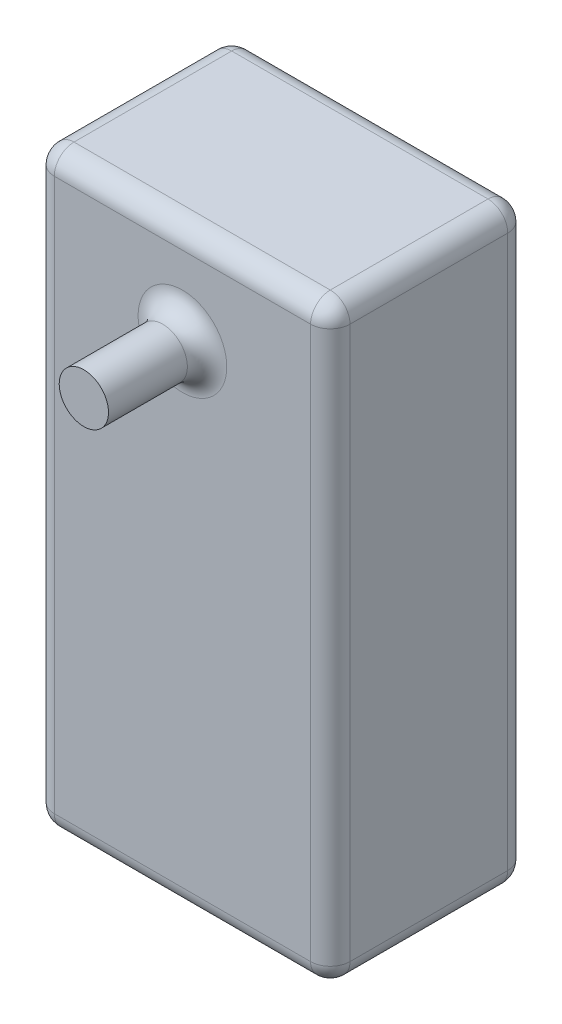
ISO-10303-21;
HEADER;
FILE_DESCRIPTION(('STEP AP214'),'2;1');
FILE_NAME('part.step','',(''),(''),'','','');
FILE_SCHEMA(('AUTOMOTIVE_DESIGN { 1 0 10303 214 1 1 1 1 }'));
ENDSEC;
DATA;
#1=APPLICATION_CONTEXT('core data for automotive mechanical design processes');
#2=APPLICATION_PROTOCOL_DEFINITION('international standard','automotive_design',2000,#1);
#3=PRODUCT_CONTEXT('',#1,'mechanical');
#4=PRODUCT('Part','Part','',(#3));
#5=PRODUCT_RELATED_PRODUCT_CATEGORY('part','',(#4));
#6=PRODUCT_DEFINITION_FORMATION('','',#4);
#7=PRODUCT_DEFINITION_CONTEXT('part definition',#1,'design');
#8=PRODUCT_DEFINITION('design','',#6,#7);
#9=PRODUCT_DEFINITION_SHAPE('','',#8);
#10=(LENGTH_UNIT() NAMED_UNIT(*) SI_UNIT(.MILLI.,.METRE.));
#11=(NAMED_UNIT(*) PLANE_ANGLE_UNIT() SI_UNIT($,.RADIAN.));
#12=(NAMED_UNIT(*) SI_UNIT($,.STERADIAN.) SOLID_ANGLE_UNIT());
#13=UNCERTAINTY_MEASURE_WITH_UNIT(LENGTH_MEASURE(1.E-05),#10,'distance_accuracy_value','');
#14=(GEOMETRIC_REPRESENTATION_CONTEXT(3) GLOBAL_UNCERTAINTY_ASSIGNED_CONTEXT((#13)) GLOBAL_UNIT_ASSIGNED_CONTEXT((#10,
#11,#12)) REPRESENTATION_CONTEXT('',''));
#15=CARTESIAN_POINT('',(0.,0.,0.));
#16=DIRECTION('',(0.,0.,1.));
#17=DIRECTION('',(1.,0.,0.));
#18=AXIS2_PLACEMENT_3D('',#15,#16,#17);
#19=CARTESIAN_POINT('',(0.,0.,20.));
#20=DIRECTION('',(1.,0.,0.));
#21=DIRECTION('',(0.,0.,-1.));
#22=AXIS2_PLACEMENT_3D('',#19,#20,#21);
#23=PLANE('',#22);
#24=DIRECTION('',(0.,0.,-1.));
#25=VECTOR('',#24,1.);
#26=CARTESIAN_POINT('',(0.,2.,20.));
#27=LINE('',#26,#25);
#28=CARTESIAN_POINT('',(0.,2.,2.));
#29=VERTEX_POINT('',#28);
#30=CARTESIAN_POINT('',(0.,2.,18.));
#31=VERTEX_POINT('',#30);
#32=EDGE_CURVE('E204',#29,#31,#27,.F.);
#33=ORIENTED_EDGE('',*,*,#32,.T.);
#34=DIRECTION('',(0.,-1.,0.));
#35=VECTOR('',#34,1.);
#36=CARTESIAN_POINT('',(0.,0.,18.));
#37=LINE('',#36,#35);
#38=CARTESIAN_POINT('',(0.,58.,18.));
#39=VERTEX_POINT('',#38);
#40=EDGE_CURVE('E211',#31,#39,#37,.F.);
#41=ORIENTED_EDGE('',*,*,#40,.T.);
#42=DIRECTION('',(0.,0.,-1.));
#43=VECTOR('',#42,1.);
#44=CARTESIAN_POINT('',(0.,58.,20.));
#45=LINE('',#44,#43);
#46=CARTESIAN_POINT('',(0.,58.,2.));
#47=VERTEX_POINT('',#46);
#48=EDGE_CURVE('E207',#39,#47,#45,.T.);
#49=ORIENTED_EDGE('',*,*,#48,.T.);
#50=DIRECTION('',(0.,-1.,0.));
#51=VECTOR('',#50,1.);
#52=CARTESIAN_POINT('',(0.,0.,2.));
#53=LINE('',#52,#51);
#54=EDGE_CURVE('E201',#47,#29,#53,.T.);
#55=ORIENTED_EDGE('',*,*,#54,.T.);
#56=EDGE_LOOP('',(#33,#41,#49,#55));
#57=FACE_BOUND('',#56,.T.);
#58=ADVANCED_FACE('F43',(#57),#23,.F.);
#59=CARTESIAN_POINT('',(0.,0.,20.));
#60=DIRECTION('',(0.,1.,0.));
#61=DIRECTION('',(-1.,0.,0.));
#62=AXIS2_PLACEMENT_3D('',#59,#60,#61);
#63=PLANE('',#62);
#64=DIRECTION('',(0.,0.,-1.));
#65=VECTOR('',#64,1.);
#66=CARTESIAN_POINT('',(28.,0.,20.));
#67=LINE('',#66,#65);
#68=CARTESIAN_POINT('',(28.,0.,2.));
#69=VERTEX_POINT('',#68);
#70=CARTESIAN_POINT('',(28.,0.,18.));
#71=VERTEX_POINT('',#70);
#72=EDGE_CURVE('E194',#69,#71,#67,.F.);
#73=ORIENTED_EDGE('',*,*,#72,.T.);
#74=DIRECTION('',(1.,0.,0.));
#75=VECTOR('',#74,1.);
#76=CARTESIAN_POINT('',(0.,0.,18.));
#77=LINE('',#76,#75);
#78=CARTESIAN_POINT('',(2.,0.,18.));
#79=VERTEX_POINT('',#78);
#80=EDGE_CURVE('E198',#71,#79,#77,.F.);
#81=ORIENTED_EDGE('',*,*,#80,.T.);
#82=DIRECTION('',(0.,0.,-1.));
#83=VECTOR('',#82,1.);
#84=CARTESIAN_POINT('',(2.,0.,20.));
#85=LINE('',#84,#83);
#86=CARTESIAN_POINT('',(2.,0.,2.));
#87=VERTEX_POINT('',#86);
#88=EDGE_CURVE('E191',#79,#87,#85,.T.);
#89=ORIENTED_EDGE('',*,*,#88,.T.);
#90=DIRECTION('',(1.,0.,0.));
#91=VECTOR('',#90,1.);
#92=CARTESIAN_POINT('',(30.,0.,2.));
#93=LINE('',#92,#91);
#94=EDGE_CURVE('E188',#87,#69,#93,.T.);
#95=ORIENTED_EDGE('',*,*,#94,.T.);
#96=EDGE_LOOP('',(#73,#81,#89,#95));
#97=FACE_BOUND('',#96,.T.);
#98=ADVANCED_FACE('F346',(#97),#63,.F.);
#99=CARTESIAN_POINT('',(30.,0.,20.));
#100=DIRECTION('',(-1.,0.,0.));
#101=DIRECTION('',(0.,-1.,0.));
#102=AXIS2_PLACEMENT_3D('',#99,#100,#101);
#103=PLANE('',#102);
#104=DIRECTION('',(0.,0.,-1.));
#105=VECTOR('',#104,1.);
#106=CARTESIAN_POINT('',(30.,58.,20.));
#107=LINE('',#106,#105);
#108=CARTESIAN_POINT('',(30.,58.,2.));
#109=VERTEX_POINT('',#108);
#110=CARTESIAN_POINT('',(30.,58.,18.));
#111=VERTEX_POINT('',#110);
#112=EDGE_CURVE('E139',#109,#111,#107,.F.);
#113=ORIENTED_EDGE('',*,*,#112,.T.);
#114=DIRECTION('',(0.,1.,0.));
#115=VECTOR('',#114,1.);
#116=CARTESIAN_POINT('',(30.,0.,18.));
#117=LINE('',#116,#115);
#118=CARTESIAN_POINT('',(30.,2.,18.));
#119=VERTEX_POINT('',#118);
#120=EDGE_CURVE('E185',#111,#119,#117,.F.);
#121=ORIENTED_EDGE('',*,*,#120,.T.);
#122=DIRECTION('',(0.,0.,-1.));
#123=VECTOR('',#122,1.);
#124=CARTESIAN_POINT('',(30.,2.,20.));
#125=LINE('',#124,#123);
#126=CARTESIAN_POINT('',(30.,2.,2.));
#127=VERTEX_POINT('',#126);
#128=EDGE_CURVE('E180',#119,#127,#125,.T.);
#129=ORIENTED_EDGE('',*,*,#128,.T.);
#130=DIRECTION('',(0.,1.,0.));
#131=VECTOR('',#130,1.);
#132=CARTESIAN_POINT('',(30.,60.,2.));
#133=LINE('',#132,#131);
#134=EDGE_CURVE('E174',#127,#109,#133,.T.);
#135=ORIENTED_EDGE('',*,*,#134,.T.);
#136=EDGE_LOOP('',(#113,#121,#129,#135));
#137=FACE_BOUND('',#136,.T.);
#138=ADVANCED_FACE('F352',(#137),#103,.F.);
#139=CARTESIAN_POINT('',(0.,60.,20.));
#140=DIRECTION('',(0.,-1.,0.));
#141=DIRECTION('',(0.,0.,-1.));
#142=AXIS2_PLACEMENT_3D('',#139,#140,#141);
#143=PLANE('',#142);
#144=DIRECTION('',(0.,0.,-1.));
#145=VECTOR('',#144,1.);
#146=CARTESIAN_POINT('',(2.,60.,20.));
#147=LINE('',#146,#145);
#148=CARTESIAN_POINT('',(2.,60.,2.));
#149=VERTEX_POINT('',#148);
#150=CARTESIAN_POINT('',(2.,60.,18.));
#151=VERTEX_POINT('',#150);
#152=EDGE_CURVE('E163',#149,#151,#147,.F.);
#153=ORIENTED_EDGE('',*,*,#152,.T.);
#154=DIRECTION('',(-1.,0.,0.));
#155=VECTOR('',#154,1.);
#156=CARTESIAN_POINT('',(0.,60.,18.));
#157=LINE('',#156,#155);
#158=CARTESIAN_POINT('',(28.,60.,18.));
#159=VERTEX_POINT('',#158);
#160=EDGE_CURVE('E168',#151,#159,#157,.F.);
#161=ORIENTED_EDGE('',*,*,#160,.T.);
#162=DIRECTION('',(0.,0.,-1.));
#163=VECTOR('',#162,1.);
#164=CARTESIAN_POINT('',(28.,60.,20.));
#165=LINE('',#164,#163);
#166=CARTESIAN_POINT('',(28.,60.,2.));
#167=VERTEX_POINT('',#166);
#168=EDGE_CURVE('E137',#159,#167,#165,.T.);
#169=ORIENTED_EDGE('',*,*,#168,.T.);
#170=DIRECTION('',(-1.,0.,0.));
#171=VECTOR('',#170,1.);
#172=CARTESIAN_POINT('',(0.,60.,2.));
#173=LINE('',#172,#171);
#174=EDGE_CURVE('E156',#167,#149,#173,.T.);
#175=ORIENTED_EDGE('',*,*,#174,.T.);
#176=EDGE_LOOP('',(#153,#161,#169,#175));
#177=FACE_BOUND('',#176,.T.);
#178=ADVANCED_FACE('F166',(#177),#143,.F.);
#179=CARTESIAN_POINT('',(0.,0.,20.));
#180=DIRECTION('',(0.,0.,-1.));
#181=DIRECTION('',(-1.,0.,0.));
#182=AXIS2_PLACEMENT_3D('',#179,#180,#181);
#183=PLANE('',#182);
#184=DIRECTION('',(0.,1.,0.));
#185=VECTOR('',#184,1.);
#186=CARTESIAN_POINT('',(28.,0.,20.));
#187=LINE('',#186,#185);
#188=CARTESIAN_POINT('',(28.,2.,20.));
#189=VERTEX_POINT('',#188);
#190=CARTESIAN_POINT('',(28.,58.,20.));
#191=VERTEX_POINT('',#190);
#192=EDGE_CURVE('E224',#189,#191,#187,.T.);
#193=ORIENTED_EDGE('',*,*,#192,.T.);
#194=DIRECTION('',(-1.,0.,0.));
#195=VECTOR('',#194,1.);
#196=CARTESIAN_POINT('',(0.,58.,20.));
#197=LINE('',#196,#195);
#198=CARTESIAN_POINT('',(2.,58.,20.));
#199=VERTEX_POINT('',#198);
#200=EDGE_CURVE('E227',#191,#199,#197,.T.);
#201=ORIENTED_EDGE('',*,*,#200,.T.);
#202=DIRECTION('',(0.,-1.,0.));
#203=VECTOR('',#202,1.);
#204=CARTESIAN_POINT('',(2.,0.,20.));
#205=LINE('',#204,#203);
#206=CARTESIAN_POINT('',(2.,2.,20.));
#207=VERTEX_POINT('',#206);
#208=EDGE_CURVE('E218',#199,#207,#205,.T.);
#209=ORIENTED_EDGE('',*,*,#208,.T.);
#210=DIRECTION('',(1.,0.,0.));
#211=VECTOR('',#210,1.);
#212=CARTESIAN_POINT('',(0.,2.,20.));
#213=LINE('',#212,#211);
#214=EDGE_CURVE('E221',#207,#189,#213,.T.);
#215=ORIENTED_EDGE('',*,*,#214,.T.);
#216=EDGE_LOOP('',(#193,#201,#209,#215));
#217=FACE_BOUND('',#216,.T.);
#218=CARTESIAN_POINT('',(15.,50.,20.));
#219=DIRECTION('',(0.,0.,-1.));
#220=DIRECTION('',(-1.,0.,0.));
#221=AXIS2_PLACEMENT_3D('',#218,#219,#220);
#222=CIRCLE('',#221,4.5);
#223=CARTESIAN_POINT('',(10.5,50.,20.));
#224=VERTEX_POINT('',#223);
#225=EDGE_CURVE('E214',#224,#224,#222,.T.);
#226=ORIENTED_EDGE('',*,*,#225,.T.);
#227=EDGE_LOOP('',(#226));
#228=FACE_BOUND('',#227,.T.);
#229=ADVANCED_FACE('F342',(#217,#228),#183,.F.);
#230=CARTESIAN_POINT('',(0.,0.,0.));
#231=DIRECTION('',(0.,0.,-1.));
#232=DIRECTION('',(-1.,0.,0.));
#233=AXIS2_PLACEMENT_3D('',#230,#231,#232);
#234=PLANE('',#233);
#235=DIRECTION('',(0.,1.,0.));
#236=VECTOR('',#235,1.);
#237=CARTESIAN_POINT('',(28.,0.,0.));
#238=LINE('',#237,#236);
#239=CARTESIAN_POINT('',(28.,58.,0.));
#240=VERTEX_POINT('',#239);
#241=CARTESIAN_POINT('',(28.,2.,0.));
#242=VERTEX_POINT('',#241);
#243=EDGE_CURVE('E53',#240,#242,#238,.F.);
#244=ORIENTED_EDGE('',*,*,#243,.T.);
#245=DIRECTION('',(1.,0.,0.));
#246=VECTOR('',#245,1.);
#247=CARTESIAN_POINT('',(0.,2.,0.));
#248=LINE('',#247,#246);
#249=CARTESIAN_POINT('',(2.,2.,0.));
#250=VERTEX_POINT('',#249);
#251=EDGE_CURVE('E11',#242,#250,#248,.F.);
#252=ORIENTED_EDGE('',*,*,#251,.T.);
#253=DIRECTION('',(0.,-1.,0.));
#254=VECTOR('',#253,1.);
#255=CARTESIAN_POINT('',(2.,60.,0.));
#256=LINE('',#255,#254);
#257=CARTESIAN_POINT('',(2.,58.,0.));
#258=VERTEX_POINT('',#257);
#259=EDGE_CURVE('E235',#250,#258,#256,.F.);
#260=ORIENTED_EDGE('',*,*,#259,.T.);
#261=DIRECTION('',(-1.,0.,0.));
#262=VECTOR('',#261,1.);
#263=CARTESIAN_POINT('',(30.,58.,0.));
#264=LINE('',#263,#262);
#265=EDGE_CURVE('E64',#258,#240,#264,.F.);
#266=ORIENTED_EDGE('',*,*,#265,.T.);
#267=EDGE_LOOP('',(#244,#252,#260,#266));
#268=FACE_BOUND('',#267,.T.);
#269=ADVANCED_FACE('F333',(#268),#234,.T.);
#270=CARTESIAN_POINT('',(15.,50.,30.));
#271=DIRECTION('',(0.,0.,-1.));
#272=DIRECTION('',(-1.,0.,0.));
#273=AXIS2_PLACEMENT_3D('',#270,#271,#272);
#274=CYLINDRICAL_SURFACE('',#273,2.5);
#275=CARTESIAN_POINT('',(15.,50.,22.));
#276=DIRECTION('',(0.,0.,-1.));
#277=DIRECTION('',(-1.,0.,0.));
#278=AXIS2_PLACEMENT_3D('',#275,#276,#277);
#279=CIRCLE('',#278,2.5);
#280=CARTESIAN_POINT('',(12.5,50.,22.));
#281=VERTEX_POINT('',#280);
#282=EDGE_CURVE('E231',#281,#281,#279,.F.);
#283=ORIENTED_EDGE('',*,*,#282,.T.);
#284=EDGE_LOOP('',(#283));
#285=FACE_BOUND('',#284,.T.);
#286=CARTESIAN_POINT('',(15.,50.,30.));
#287=DIRECTION('',(0.,0.,1.));
#288=DIRECTION('',(1.,0.,0.));
#289=AXIS2_PLACEMENT_3D('',#286,#287,#288);
#290=CIRCLE('',#289,2.5);
#291=CARTESIAN_POINT('',(17.5,50.,30.));
#292=VERTEX_POINT('',#291);
#293=EDGE_CURVE('E164',#292,#292,#290,.T.);
#294=ORIENTED_EDGE('',*,*,#293,.F.);
#295=EDGE_LOOP('',(#294));
#296=FACE_BOUND('',#295,.T.);
#297=ADVANCED_FACE('F331',(#285,#296),#274,.T.);
#298=CARTESIAN_POINT('',(15.,50.,30.));
#299=DIRECTION('',(0.,0.,1.));
#300=DIRECTION('',(1.,0.,0.));
#301=AXIS2_PLACEMENT_3D('',#298,#299,#300);
#302=PLANE('',#301);
#303=ORIENTED_EDGE('',*,*,#293,.T.);
#304=EDGE_LOOP('',(#303));
#305=FACE_BOUND('',#304,.T.);
#306=ADVANCED_FACE('F329',(#305),#302,.T.);
#307=CARTESIAN_POINT('',(2.,2.,20.));
#308=DIRECTION('',(0.,0.,-1.));
#309=DIRECTION('',(-1.,0.,0.));
#310=AXIS2_PLACEMENT_3D('',#307,#308,#309);
#311=CYLINDRICAL_SURFACE('',#310,2.);
#312=CARTESIAN_POINT('',(2.,2.,18.));
#313=DIRECTION('',(0.,0.,1.));
#314=DIRECTION('',(1.,0.,0.));
#315=AXIS2_PLACEMENT_3D('',#312,#313,#314);
#316=CIRCLE('',#315,2.);
#317=EDGE_CURVE('E47',#31,#79,#316,.T.);
#318=ORIENTED_EDGE('',*,*,#317,.F.);
#319=ORIENTED_EDGE('',*,*,#32,.F.);
#320=CARTESIAN_POINT('',(2.,2.,2.));
#321=DIRECTION('',(0.,0.,-1.));
#322=DIRECTION('',(-1.,0.,0.));
#323=AXIS2_PLACEMENT_3D('',#320,#321,#322);
#324=CIRCLE('',#323,2.);
#325=EDGE_CURVE('E311',#87,#29,#324,.T.);
#326=ORIENTED_EDGE('',*,*,#325,.F.);
#327=ORIENTED_EDGE('',*,*,#88,.F.);
#328=EDGE_LOOP('',(#318,#319,#326,#327));
#329=FACE_BOUND('',#328,.T.);
#330=ADVANCED_FACE('F340',(#329),#311,.T.);
#331=CARTESIAN_POINT('',(2.,2.,18.));
#332=DIRECTION('',(0.,-1.,0.));
#333=DIRECTION('',(0.,0.,-1.));
#334=AXIS2_PLACEMENT_3D('',#331,#332,#333);
#335=SPHERICAL_SURFACE('',#334,2.);
#336=CARTESIAN_POINT('',(2.,2.,18.));
#337=DIRECTION('',(0.,-1.,0.));
#338=DIRECTION('',(0.,0.,-1.));
#339=AXIS2_PLACEMENT_3D('',#336,#337,#338);
#340=CIRCLE('',#339,2.);
#341=EDGE_CURVE('E304',#31,#207,#340,.F.);
#342=ORIENTED_EDGE('',*,*,#341,.F.);
#343=ORIENTED_EDGE('',*,*,#317,.T.);
#344=CARTESIAN_POINT('',(2.,2.,18.));
#345=DIRECTION('',(-1.,0.,0.));
#346=DIRECTION('',(0.,0.,1.));
#347=AXIS2_PLACEMENT_3D('',#344,#345,#346);
#348=CIRCLE('',#347,2.);
#349=EDGE_CURVE('E308',#207,#79,#348,.F.);
#350=ORIENTED_EDGE('',*,*,#349,.F.);
#351=EDGE_LOOP('',(#342,#343,#350));
#352=FACE_BOUND('',#351,.T.);
#353=ADVANCED_FACE('F422',(#352),#335,.T.);
#354=CARTESIAN_POINT('',(2.,2.,2.));
#355=DIRECTION('',(-1.,0.,0.));
#356=DIRECTION('',(0.,0.,1.));
#357=AXIS2_PLACEMENT_3D('',#354,#355,#356);
#358=SPHERICAL_SURFACE('',#357,2.);
#359=CARTESIAN_POINT('',(2.,2.,2.));
#360=DIRECTION('',(-1.,0.,0.));
#361=DIRECTION('',(0.,0.,1.));
#362=AXIS2_PLACEMENT_3D('',#359,#360,#361);
#363=CIRCLE('',#362,2.);
#364=EDGE_CURVE('E296',#87,#250,#363,.F.);
#365=ORIENTED_EDGE('',*,*,#364,.F.);
#366=ORIENTED_EDGE('',*,*,#325,.T.);
#367=CARTESIAN_POINT('',(2.,2.,2.));
#368=DIRECTION('',(0.,-1.,0.));
#369=DIRECTION('',(0.,0.,-1.));
#370=AXIS2_PLACEMENT_3D('',#367,#368,#369);
#371=CIRCLE('',#370,2.);
#372=EDGE_CURVE('E300',#250,#29,#371,.F.);
#373=ORIENTED_EDGE('',*,*,#372,.F.);
#374=EDGE_LOOP('',(#365,#366,#373));
#375=FACE_BOUND('',#374,.T.);
#376=ADVANCED_FACE('F418',(#375),#358,.T.);
#377=CARTESIAN_POINT('',(0.,2.,18.));
#378=DIRECTION('',(1.,0.,0.));
#379=DIRECTION('',(0.,1.,0.));
#380=AXIS2_PLACEMENT_3D('',#377,#378,#379);
#381=CYLINDRICAL_SURFACE('',#380,2.);
#382=ORIENTED_EDGE('',*,*,#349,.T.);
#383=ORIENTED_EDGE('',*,*,#80,.F.);
#384=CARTESIAN_POINT('',(28.,2.,18.));
#385=DIRECTION('',(1.,0.,0.));
#386=DIRECTION('',(0.,0.,-1.));
#387=AXIS2_PLACEMENT_3D('',#384,#385,#386);
#388=CIRCLE('',#387,2.);
#389=EDGE_CURVE('E289',#189,#71,#388,.T.);
#390=ORIENTED_EDGE('',*,*,#389,.F.);
#391=ORIENTED_EDGE('',*,*,#214,.F.);
#392=EDGE_LOOP('',(#382,#383,#390,#391));
#393=FACE_BOUND('',#392,.T.);
#394=ADVANCED_FACE('F414',(#393),#381,.T.);
#395=CARTESIAN_POINT('',(2.,0.,18.));
#396=DIRECTION('',(0.,-1.,0.));
#397=DIRECTION('',(0.,0.,-1.));
#398=AXIS2_PLACEMENT_3D('',#395,#396,#397);
#399=CYLINDRICAL_SURFACE('',#398,2.);
#400=ORIENTED_EDGE('',*,*,#341,.T.);
#401=ORIENTED_EDGE('',*,*,#208,.F.);
#402=CARTESIAN_POINT('',(2.,58.,18.));
#403=DIRECTION('',(0.,1.,0.));
#404=DIRECTION('',(0.,0.,1.));
#405=AXIS2_PLACEMENT_3D('',#402,#403,#404);
#406=CIRCLE('',#405,2.);
#407=EDGE_CURVE('E285',#39,#199,#406,.T.);
#408=ORIENTED_EDGE('',*,*,#407,.F.);
#409=ORIENTED_EDGE('',*,*,#40,.F.);
#410=EDGE_LOOP('',(#400,#401,#408,#409));
#411=FACE_BOUND('',#410,.T.);
#412=ADVANCED_FACE('F410',(#411),#399,.T.);
#413=CARTESIAN_POINT('',(2.,58.,20.));
#414=DIRECTION('',(0.,0.,-1.));
#415=DIRECTION('',(-1.,0.,0.));
#416=AXIS2_PLACEMENT_3D('',#413,#414,#415);
#417=CYLINDRICAL_SURFACE('',#416,2.);
#418=CARTESIAN_POINT('',(2.,58.,2.));
#419=DIRECTION('',(0.,0.,-1.));
#420=DIRECTION('',(-1.,0.,0.));
#421=AXIS2_PLACEMENT_3D('',#418,#419,#420);
#422=CIRCLE('',#421,2.);
#423=EDGE_CURVE('E277',#47,#149,#422,.T.);
#424=ORIENTED_EDGE('',*,*,#423,.F.);
#425=ORIENTED_EDGE('',*,*,#48,.F.);
#426=CARTESIAN_POINT('',(2.,58.,18.));
#427=DIRECTION('',(0.,0.,1.));
#428=DIRECTION('',(1.,0.,0.));
#429=AXIS2_PLACEMENT_3D('',#426,#427,#428);
#430=CIRCLE('',#429,2.);
#431=EDGE_CURVE('E281',#151,#39,#430,.T.);
#432=ORIENTED_EDGE('',*,*,#431,.F.);
#433=ORIENTED_EDGE('',*,*,#152,.F.);
#434=EDGE_LOOP('',(#424,#425,#432,#433));
#435=FACE_BOUND('',#434,.T.);
#436=ADVANCED_FACE('F406',(#435),#417,.T.);
#437=CARTESIAN_POINT('',(2.,0.,2.));
#438=DIRECTION('',(0.,1.,0.));
#439=DIRECTION('',(0.,0.,1.));
#440=AXIS2_PLACEMENT_3D('',#437,#438,#439);
#441=CYLINDRICAL_SURFACE('',#440,2.);
#442=ORIENTED_EDGE('',*,*,#372,.T.);
#443=ORIENTED_EDGE('',*,*,#54,.F.);
#444=CARTESIAN_POINT('',(2.,58.,2.));
#445=DIRECTION('',(0.,1.,0.));
#446=DIRECTION('',(0.,0.,1.));
#447=AXIS2_PLACEMENT_3D('',#444,#445,#446);
#448=CIRCLE('',#447,2.);
#449=EDGE_CURVE('E274',#258,#47,#448,.T.);
#450=ORIENTED_EDGE('',*,*,#449,.F.);
#451=ORIENTED_EDGE('',*,*,#259,.F.);
#452=EDGE_LOOP('',(#442,#443,#450,#451));
#453=FACE_BOUND('',#452,.T.);
#454=ADVANCED_FACE('F402',(#453),#441,.T.);
#455=CARTESIAN_POINT('',(0.,2.,2.));
#456=DIRECTION('',(-1.,0.,0.));
#457=DIRECTION('',(0.,-1.,0.));
#458=AXIS2_PLACEMENT_3D('',#455,#456,#457);
#459=CYLINDRICAL_SURFACE('',#458,2.);
#460=ORIENTED_EDGE('',*,*,#364,.T.);
#461=ORIENTED_EDGE('',*,*,#251,.F.);
#462=CARTESIAN_POINT('',(28.,2.,2.));
#463=DIRECTION('',(1.,0.,0.));
#464=DIRECTION('',(0.,0.,-1.));
#465=AXIS2_PLACEMENT_3D('',#462,#463,#464);
#466=CIRCLE('',#465,2.);
#467=EDGE_CURVE('E270',#69,#242,#466,.T.);
#468=ORIENTED_EDGE('',*,*,#467,.F.);
#469=ORIENTED_EDGE('',*,*,#94,.F.);
#470=EDGE_LOOP('',(#460,#461,#468,#469));
#471=FACE_BOUND('',#470,.T.);
#472=ADVANCED_FACE('F398',(#471),#459,.T.);
#473=CARTESIAN_POINT('',(28.,2.,20.));
#474=DIRECTION('',(0.,0.,-1.));
#475=DIRECTION('',(-1.,0.,0.));
#476=AXIS2_PLACEMENT_3D('',#473,#474,#475);
#477=CYLINDRICAL_SURFACE('',#476,2.);
#478=CARTESIAN_POINT('',(28.,2.,18.));
#479=DIRECTION('',(0.,0.,1.));
#480=DIRECTION('',(1.,0.,0.));
#481=AXIS2_PLACEMENT_3D('',#478,#479,#480);
#482=CIRCLE('',#481,2.);
#483=EDGE_CURVE('E292',#71,#119,#482,.T.);
#484=ORIENTED_EDGE('',*,*,#483,.F.);
#485=ORIENTED_EDGE('',*,*,#72,.F.);
#486=CARTESIAN_POINT('',(28.,2.,2.));
#487=DIRECTION('',(0.,0.,-1.));
#488=DIRECTION('',(-1.,0.,0.));
#489=AXIS2_PLACEMENT_3D('',#486,#487,#488);
#490=CIRCLE('',#489,2.);
#491=EDGE_CURVE('E266',#127,#69,#490,.T.);
#492=ORIENTED_EDGE('',*,*,#491,.F.);
#493=ORIENTED_EDGE('',*,*,#128,.F.);
#494=EDGE_LOOP('',(#484,#485,#492,#493));
#495=FACE_BOUND('',#494,.T.);
#496=ADVANCED_FACE('F394',(#495),#477,.T.);
#497=CARTESIAN_POINT('',(28.,2.,18.));
#498=DIRECTION('',(0.,-1.,0.));
#499=DIRECTION('',(0.,0.,-1.));
#500=AXIS2_PLACEMENT_3D('',#497,#498,#499);
#501=SPHERICAL_SURFACE('',#500,2.);
#502=ORIENTED_EDGE('',*,*,#389,.T.);
#503=ORIENTED_EDGE('',*,*,#483,.T.);
#504=CARTESIAN_POINT('',(28.,2.,18.));
#505=DIRECTION('',(0.,-1.,0.));
#506=DIRECTION('',(1.,0.,0.));
#507=AXIS2_PLACEMENT_3D('',#504,#505,#506);
#508=CIRCLE('',#507,2.);
#509=EDGE_CURVE('E262',#189,#119,#508,.F.);
#510=ORIENTED_EDGE('',*,*,#509,.F.);
#511=EDGE_LOOP('',(#502,#503,#510));
#512=FACE_BOUND('',#511,.T.);
#513=ADVANCED_FACE('F390',(#512),#501,.T.);
#514=CARTESIAN_POINT('',(2.,58.,18.));
#515=DIRECTION('',(-1.,0.,0.));
#516=DIRECTION('',(0.,0.,1.));
#517=AXIS2_PLACEMENT_3D('',#514,#515,#516);
#518=SPHERICAL_SURFACE('',#517,2.);
#519=ORIENTED_EDGE('',*,*,#431,.T.);
#520=ORIENTED_EDGE('',*,*,#407,.T.);
#521=CARTESIAN_POINT('',(2.,58.,18.));
#522=DIRECTION('',(-1.,0.,0.));
#523=DIRECTION('',(0.,0.,1.));
#524=AXIS2_PLACEMENT_3D('',#521,#522,#523);
#525=CIRCLE('',#524,2.);
#526=EDGE_CURVE('E259',#151,#199,#525,.F.);
#527=ORIENTED_EDGE('',*,*,#526,.F.);
#528=EDGE_LOOP('',(#519,#520,#527));
#529=FACE_BOUND('',#528,.T.);
#530=ADVANCED_FACE('F386',(#529),#518,.T.);
#531=CARTESIAN_POINT('',(2.,58.,2.));
#532=DIRECTION('',(-1.,0.,0.));
#533=DIRECTION('',(0.,0.,1.));
#534=AXIS2_PLACEMENT_3D('',#531,#532,#533);
#535=SPHERICAL_SURFACE('',#534,2.);
#536=ORIENTED_EDGE('',*,*,#449,.T.);
#537=ORIENTED_EDGE('',*,*,#423,.T.);
#538=CARTESIAN_POINT('',(2.,58.,2.));
#539=DIRECTION('',(-1.,0.,0.));
#540=DIRECTION('',(0.,0.,1.));
#541=AXIS2_PLACEMENT_3D('',#538,#539,#540);
#542=CIRCLE('',#541,2.);
#543=EDGE_CURVE('E159',#258,#149,#542,.F.);
#544=ORIENTED_EDGE('',*,*,#543,.F.);
#545=EDGE_LOOP('',(#536,#537,#544));
#546=FACE_BOUND('',#545,.T.);
#547=ADVANCED_FACE('F382',(#546),#535,.T.);
#548=CARTESIAN_POINT('',(28.,2.,2.));
#549=DIRECTION('',(0.,-1.,0.));
#550=DIRECTION('',(0.,0.,-1.));
#551=AXIS2_PLACEMENT_3D('',#548,#549,#550);
#552=SPHERICAL_SURFACE('',#551,2.);
#553=ORIENTED_EDGE('',*,*,#491,.T.);
#554=ORIENTED_EDGE('',*,*,#467,.T.);
#555=CARTESIAN_POINT('',(28.,2.,2.));
#556=DIRECTION('',(0.,-1.,0.));
#557=DIRECTION('',(1.,0.,0.));
#558=AXIS2_PLACEMENT_3D('',#555,#556,#557);
#559=CIRCLE('',#558,2.);
#560=EDGE_CURVE('E253',#127,#242,#559,.F.);
#561=ORIENTED_EDGE('',*,*,#560,.F.);
#562=EDGE_LOOP('',(#553,#554,#561));
#563=FACE_BOUND('',#562,.T.);
#564=ADVANCED_FACE('F378',(#563),#552,.T.);
#565=CARTESIAN_POINT('',(28.,0.,18.));
#566=DIRECTION('',(0.,1.,0.));
#567=DIRECTION('',(-1.,0.,0.));
#568=AXIS2_PLACEMENT_3D('',#565,#566,#567);
#569=CYLINDRICAL_SURFACE('',#568,2.);
#570=ORIENTED_EDGE('',*,*,#509,.T.);
#571=ORIENTED_EDGE('',*,*,#120,.F.);
#572=CARTESIAN_POINT('',(28.,58.,18.));
#573=DIRECTION('',(0.,1.,0.));
#574=DIRECTION('',(0.,0.,1.));
#575=AXIS2_PLACEMENT_3D('',#572,#573,#574);
#576=CIRCLE('',#575,2.);
#577=EDGE_CURVE('E249',#191,#111,#576,.T.);
#578=ORIENTED_EDGE('',*,*,#577,.F.);
#579=ORIENTED_EDGE('',*,*,#192,.F.);
#580=EDGE_LOOP('',(#570,#571,#578,#579));
#581=FACE_BOUND('',#580,.T.);
#582=ADVANCED_FACE('F374',(#581),#569,.T.);
#583=CARTESIAN_POINT('',(0.,58.,18.));
#584=DIRECTION('',(-1.,0.,0.));
#585=DIRECTION('',(0.,0.,1.));
#586=AXIS2_PLACEMENT_3D('',#583,#584,#585);
#587=CYLINDRICAL_SURFACE('',#586,2.);
#588=ORIENTED_EDGE('',*,*,#526,.T.);
#589=ORIENTED_EDGE('',*,*,#200,.F.);
#590=CARTESIAN_POINT('',(28.,58.,18.));
#591=DIRECTION('',(1.,0.,0.));
#592=DIRECTION('',(0.,0.,-1.));
#593=AXIS2_PLACEMENT_3D('',#590,#591,#592);
#594=CIRCLE('',#593,2.);
#595=EDGE_CURVE('E153',#159,#191,#594,.T.);
#596=ORIENTED_EDGE('',*,*,#595,.F.);
#597=ORIENTED_EDGE('',*,*,#160,.F.);
#598=EDGE_LOOP('',(#588,#589,#596,#597));
#599=FACE_BOUND('',#598,.T.);
#600=ADVANCED_FACE('F371',(#599),#587,.T.);
#601=CARTESIAN_POINT('',(0.,58.,2.));
#602=DIRECTION('',(1.,0.,0.));
#603=DIRECTION('',(0.,0.,-1.));
#604=AXIS2_PLACEMENT_3D('',#601,#602,#603);
#605=CYLINDRICAL_SURFACE('',#604,2.);
#606=ORIENTED_EDGE('',*,*,#543,.T.);
#607=ORIENTED_EDGE('',*,*,#174,.F.);
#608=CARTESIAN_POINT('',(28.,58.,2.));
#609=DIRECTION('',(1.,0.,0.));
#610=DIRECTION('',(0.,0.,-1.));
#611=AXIS2_PLACEMENT_3D('',#608,#609,#610);
#612=CIRCLE('',#611,2.);
#613=EDGE_CURVE('E146',#240,#167,#612,.T.);
#614=ORIENTED_EDGE('',*,*,#613,.F.);
#615=ORIENTED_EDGE('',*,*,#265,.F.);
#616=EDGE_LOOP('',(#606,#607,#614,#615));
#617=FACE_BOUND('',#616,.T.);
#618=ADVANCED_FACE('F157',(#617),#605,.T.);
#619=CARTESIAN_POINT('',(28.,0.,2.));
#620=DIRECTION('',(0.,-1.,0.));
#621=DIRECTION('',(1.,0.,0.));
#622=AXIS2_PLACEMENT_3D('',#619,#620,#621);
#623=CYLINDRICAL_SURFACE('',#622,2.);
#624=ORIENTED_EDGE('',*,*,#560,.T.);
#625=ORIENTED_EDGE('',*,*,#243,.F.);
#626=CARTESIAN_POINT('',(28.,58.,2.));
#627=DIRECTION('',(0.,1.,0.));
#628=DIRECTION('',(0.,0.,1.));
#629=AXIS2_PLACEMENT_3D('',#626,#627,#628);
#630=CIRCLE('',#629,2.);
#631=EDGE_CURVE('E150',#109,#240,#630,.T.);
#632=ORIENTED_EDGE('',*,*,#631,.F.);
#633=ORIENTED_EDGE('',*,*,#134,.F.);
#634=EDGE_LOOP('',(#624,#625,#632,#633));
#635=FACE_BOUND('',#634,.T.);
#636=ADVANCED_FACE('F364',(#635),#623,.T.);
#637=CARTESIAN_POINT('',(28.,58.,18.));
#638=DIRECTION('',(0.,0.,1.));
#639=DIRECTION('',(1.,0.,0.));
#640=AXIS2_PLACEMENT_3D('',#637,#638,#639);
#641=SPHERICAL_SURFACE('',#640,2.);
#642=ORIENTED_EDGE('',*,*,#595,.T.);
#643=ORIENTED_EDGE('',*,*,#577,.T.);
#644=CARTESIAN_POINT('',(28.,58.,18.));
#645=DIRECTION('',(0.,0.,1.));
#646=DIRECTION('',(1.,0.,0.));
#647=AXIS2_PLACEMENT_3D('',#644,#645,#646);
#648=CIRCLE('',#647,2.);
#649=EDGE_CURVE('E143',#159,#111,#648,.F.);
#650=ORIENTED_EDGE('',*,*,#649,.F.);
#651=EDGE_LOOP('',(#642,#643,#650));
#652=FACE_BOUND('',#651,.T.);
#653=ADVANCED_FACE('F361',(#652),#641,.T.);
#654=CARTESIAN_POINT('',(28.,58.,2.));
#655=DIRECTION('',(0.,0.,-1.));
#656=DIRECTION('',(-1.,0.,0.));
#657=AXIS2_PLACEMENT_3D('',#654,#655,#656);
#658=SPHERICAL_SURFACE('',#657,2.);
#659=ORIENTED_EDGE('',*,*,#631,.T.);
#660=ORIENTED_EDGE('',*,*,#613,.T.);
#661=CARTESIAN_POINT('',(28.,58.,2.));
#662=DIRECTION('',(0.,0.,-1.));
#663=DIRECTION('',(-1.,0.,0.));
#664=AXIS2_PLACEMENT_3D('',#661,#662,#663);
#665=CIRCLE('',#664,2.);
#666=EDGE_CURVE('E133',#109,#167,#665,.F.);
#667=ORIENTED_EDGE('',*,*,#666,.F.);
#668=EDGE_LOOP('',(#659,#660,#667));
#669=FACE_BOUND('',#668,.T.);
#670=ADVANCED_FACE('F148',(#669),#658,.T.);
#671=CARTESIAN_POINT('',(28.,58.,20.));
#672=DIRECTION('',(0.,0.,-1.));
#673=DIRECTION('',(-1.,0.,0.));
#674=AXIS2_PLACEMENT_3D('',#671,#672,#673);
#675=CYLINDRICAL_SURFACE('',#674,2.);
#676=ORIENTED_EDGE('',*,*,#649,.T.);
#677=ORIENTED_EDGE('',*,*,#112,.F.);
#678=ORIENTED_EDGE('',*,*,#666,.T.);
#679=ORIENTED_EDGE('',*,*,#168,.F.);
#680=EDGE_LOOP('',(#676,#677,#678,#679));
#681=FACE_BOUND('',#680,.T.);
#682=ADVANCED_FACE('F135',(#681),#675,.T.);
#683=CARTESIAN_POINT('',(15.,50.,22.));
#684=DIRECTION('',(0.,0.,-1.));
#685=DIRECTION('',(-1.,0.,0.));
#686=AXIS2_PLACEMENT_3D('',#683,#684,#685);
#687=TOROIDAL_SURFACE('',#686,4.5,2.);
#688=ORIENTED_EDGE('',*,*,#225,.F.);
#689=EDGE_LOOP('',(#688));
#690=FACE_BOUND('',#689,.T.);
#691=ORIENTED_EDGE('',*,*,#282,.F.);
#692=EDGE_LOOP('',(#691));
#693=FACE_BOUND('',#692,.T.);
#694=ADVANCED_FACE('F45',(#690,#693),#687,.F.);
#695=CLOSED_SHELL('',(#58,#98,#138,#178,#229,#269,#297,#306,#330,#353,#376,#394,#412,#436,#454,
#472,#496,#513,#530,#547,#564,#582,#600,#618,#636,#653,#670,#682,#694));
#696=MANIFOLD_SOLID_BREP('B2',#695);
#697=ADVANCED_BREP_SHAPE_REPRESENTATION('',(#18,#696),#14);
#698=SHAPE_DEFINITION_REPRESENTATION(#9,#697);
ENDSEC;
END-ISO-10303-21;
